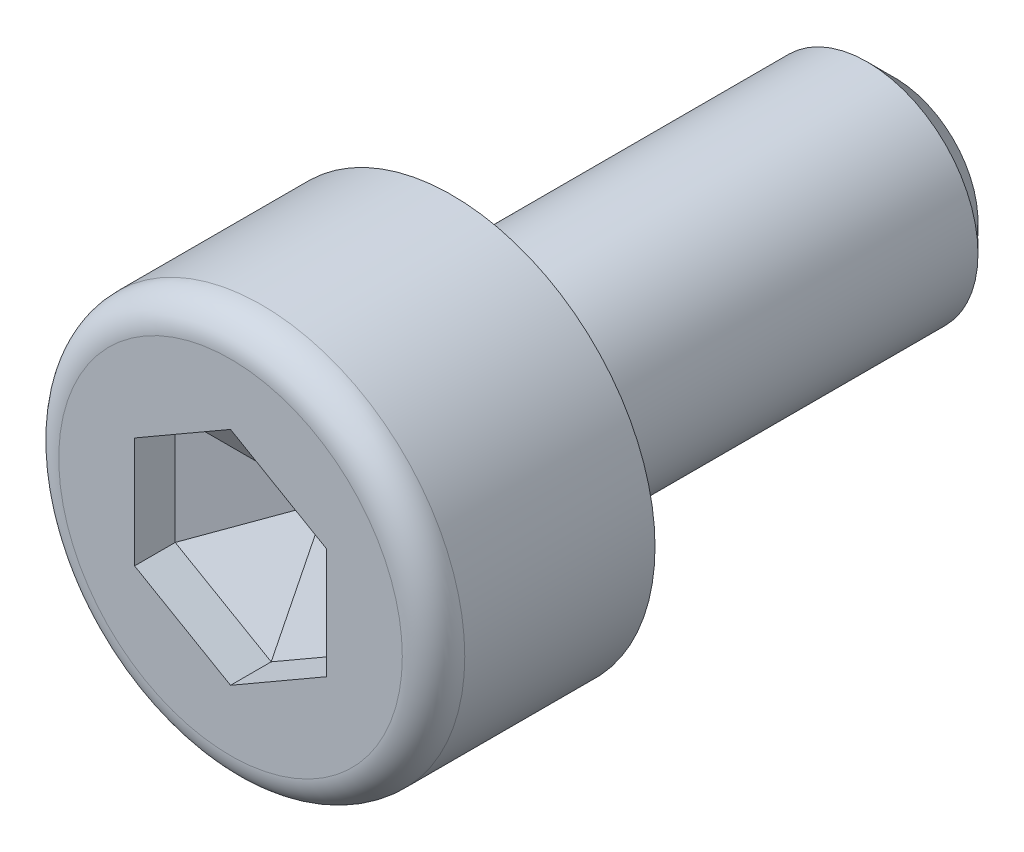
ISO-10303-21;
HEADER;
FILE_DESCRIPTION(('STEP AP214'),'2;1');
FILE_NAME('part.step','',(''),(''),'','','');
FILE_SCHEMA(('AUTOMOTIVE_DESIGN { 1 0 10303 214 1 1 1 1 }'));
ENDSEC;
DATA;
#1=APPLICATION_CONTEXT('core data for automotive mechanical design processes');
#2=APPLICATION_PROTOCOL_DEFINITION('international standard','automotive_design',2000,#1);
#3=PRODUCT_CONTEXT('',#1,'mechanical');
#4=PRODUCT('Part','Part','',(#3));
#5=PRODUCT_RELATED_PRODUCT_CATEGORY('part','',(#4));
#6=PRODUCT_DEFINITION_FORMATION('','',#4);
#7=PRODUCT_DEFINITION_CONTEXT('part definition',#1,'design');
#8=PRODUCT_DEFINITION('design','',#6,#7);
#9=PRODUCT_DEFINITION_SHAPE('','',#8);
#10=(LENGTH_UNIT() NAMED_UNIT(*) SI_UNIT(.MILLI.,.METRE.));
#11=(NAMED_UNIT(*) PLANE_ANGLE_UNIT() SI_UNIT($,.RADIAN.));
#12=(NAMED_UNIT(*) SI_UNIT($,.STERADIAN.) SOLID_ANGLE_UNIT());
#13=UNCERTAINTY_MEASURE_WITH_UNIT(LENGTH_MEASURE(1.E-05),#10,'distance_accuracy_value','');
#14=(GEOMETRIC_REPRESENTATION_CONTEXT(3) GLOBAL_UNCERTAINTY_ASSIGNED_CONTEXT((#13)) GLOBAL_UNIT_ASSIGNED_CONTEXT((#10,
#11,#12)) REPRESENTATION_CONTEXT('',''));
#15=CARTESIAN_POINT('',(0.,0.,0.));
#16=DIRECTION('',(0.,0.,1.));
#17=DIRECTION('',(1.,0.,0.));
#18=AXIS2_PLACEMENT_3D('',#15,#16,#17);
#19=CARTESIAN_POINT('',(0.,0.,0.));
#20=DIRECTION('',(0.,0.,1.));
#21=DIRECTION('',(1.,0.,0.));
#22=AXIS2_PLACEMENT_3D('',#19,#20,#21);
#23=PLANE('',#22);
#24=CARTESIAN_POINT('',(0.,0.,0.));
#25=DIRECTION('',(0.,0.,1.));
#26=DIRECTION('',(1.,0.,0.));
#27=AXIS2_PLACEMENT_3D('',#24,#25,#26);
#28=CIRCLE('',#27,1.6);
#29=CARTESIAN_POINT('',(1.6,0.,0.));
#30=VERTEX_POINT('',#29);
#31=EDGE_CURVE('E11',#30,#30,#28,.T.);
#32=ORIENTED_EDGE('',*,*,#31,.T.);
#33=EDGE_LOOP('',(#32));
#34=FACE_BOUND('',#33,.T.);
#35=CARTESIAN_POINT('',(0.,0.,0.));
#36=DIRECTION('',(0.,0.,1.));
#37=DIRECTION('',(1.,0.,0.));
#38=AXIS2_PLACEMENT_3D('',#35,#36,#37);
#39=CIRCLE('',#38,2.75);
#40=CARTESIAN_POINT('',(2.75,0.,0.));
#41=VERTEX_POINT('',#40);
#42=EDGE_CURVE('E160',#41,#41,#39,.T.);
#43=ORIENTED_EDGE('',*,*,#42,.F.);
#44=EDGE_LOOP('',(#43));
#45=FACE_BOUND('',#44,.T.);
#46=ADVANCED_FACE('F50',(#34,#45),#23,.F.);
#47=CARTESIAN_POINT('',(0.,0.,3.));
#48=DIRECTION('',(0.,0.,-1.));
#49=DIRECTION('',(-1.,0.,0.));
#50=AXIS2_PLACEMENT_3D('',#47,#48,#49);
#51=CYLINDRICAL_SURFACE('',#50,2.75);
#52=CARTESIAN_POINT('',(0.,0.,2.57692307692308));
#53=DIRECTION('',(0.,0.,1.));
#54=DIRECTION('',(1.,0.,0.));
#55=AXIS2_PLACEMENT_3D('',#52,#53,#54);
#56=CIRCLE('',#55,2.75);
#57=CARTESIAN_POINT('',(2.75,0.,2.57692307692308));
#58=VERTEX_POINT('',#57);
#59=EDGE_CURVE('E178',#58,#58,#56,.F.);
#60=ORIENTED_EDGE('',*,*,#59,.T.);
#61=EDGE_LOOP('',(#60));
#62=FACE_BOUND('',#61,.T.);
#63=ORIENTED_EDGE('',*,*,#42,.T.);
#64=EDGE_LOOP('',(#63));
#65=FACE_BOUND('',#64,.T.);
#66=ADVANCED_FACE('F237',(#62,#65),#51,.T.);
#67=CARTESIAN_POINT('',(0.,0.,3.));
#68=DIRECTION('',(0.,0.,1.));
#69=DIRECTION('',(1.,0.,0.));
#70=AXIS2_PLACEMENT_3D('',#67,#68,#69);
#71=PLANE('',#70);
#72=CARTESIAN_POINT('',(0.,0.,3.));
#73=DIRECTION('',(0.,0.,1.));
#74=DIRECTION('',(1.,0.,0.));
#75=AXIS2_PLACEMENT_3D('',#72,#73,#74);
#76=CIRCLE('',#75,2.32692307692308);
#77=CARTESIAN_POINT('',(2.32692307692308,0.,3.));
#78=VERTEX_POINT('',#77);
#79=EDGE_CURVE('E175',#78,#78,#76,.T.);
#80=ORIENTED_EDGE('',*,*,#79,.T.);
#81=EDGE_LOOP('',(#80));
#82=FACE_BOUND('',#81,.T.);
#83=DIRECTION('',(0.,1.,0.));
#84=VECTOR('',#83,1.);
#85=CARTESIAN_POINT('',(1.3,-0.750555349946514,3.));
#86=LINE('',#85,#84);
#87=CARTESIAN_POINT('',(1.3,-0.750555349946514,3.));
#88=VERTEX_POINT('',#87);
#89=CARTESIAN_POINT('',(1.3,0.750555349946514,3.));
#90=VERTEX_POINT('',#89);
#91=EDGE_CURVE('E142',#88,#90,#86,.T.);
#92=ORIENTED_EDGE('',*,*,#91,.F.);
#93=DIRECTION('',(0.866025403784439,0.5,0.));
#94=VECTOR('',#93,1.);
#95=CARTESIAN_POINT('',(0.,-1.50111069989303,3.));
#96=LINE('',#95,#94);
#97=CARTESIAN_POINT('',(0.,-1.50111069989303,3.));
#98=VERTEX_POINT('',#97);
#99=EDGE_CURVE('E155',#98,#88,#96,.T.);
#100=ORIENTED_EDGE('',*,*,#99,.F.);
#101=DIRECTION('',(0.866025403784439,-0.5,0.));
#102=VECTOR('',#101,1.);
#103=CARTESIAN_POINT('',(-1.3,-0.750555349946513,3.));
#104=LINE('',#103,#102);
#105=CARTESIAN_POINT('',(-1.3,-0.750555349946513,3.));
#106=VERTEX_POINT('',#105);
#107=EDGE_CURVE('E149',#106,#98,#104,.T.);
#108=ORIENTED_EDGE('',*,*,#107,.F.);
#109=DIRECTION('',(0.,-1.,0.));
#110=VECTOR('',#109,1.);
#111=CARTESIAN_POINT('',(-1.3,0.750555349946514,3.));
#112=LINE('',#111,#110);
#113=CARTESIAN_POINT('',(-1.3,0.750555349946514,3.));
#114=VERTEX_POINT('',#113);
#115=EDGE_CURVE('E147',#114,#106,#112,.T.);
#116=ORIENTED_EDGE('',*,*,#115,.F.);
#117=DIRECTION('',(-0.866025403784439,-0.5,0.));
#118=VECTOR('',#117,1.);
#119=CARTESIAN_POINT('',(0.,1.50111069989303,3.));
#120=LINE('',#119,#118);
#121=CARTESIAN_POINT('',(0.,1.50111069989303,3.));
#122=VERTEX_POINT('',#121);
#123=EDGE_CURVE('E127',#122,#114,#120,.T.);
#124=ORIENTED_EDGE('',*,*,#123,.F.);
#125=DIRECTION('',(-0.866025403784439,0.5,0.));
#126=VECTOR('',#125,1.);
#127=CARTESIAN_POINT('',(1.3,0.750555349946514,3.));
#128=LINE('',#127,#126);
#129=EDGE_CURVE('E137',#90,#122,#128,.T.);
#130=ORIENTED_EDGE('',*,*,#129,.F.);
#131=EDGE_LOOP('',(#92,#100,#108,#116,#124,#130));
#132=FACE_BOUND('',#131,.T.);
#133=ADVANCED_FACE('F144',(#82,#132),#71,.T.);
#134=CARTESIAN_POINT('',(1.3,-0.750555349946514,1.7));
#135=DIRECTION('',(1.,0.,0.));
#136=DIRECTION('',(0.,1.,0.));
#137=AXIS2_PLACEMENT_3D('',#134,#135,#136);
#138=PLANE('',#137);
#139=DIRECTION('',(0.,0.,1.));
#140=VECTOR('',#139,1.);
#141=CARTESIAN_POINT('',(1.3,0.750555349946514,1.7));
#142=LINE('',#141,#140);
#143=CARTESIAN_POINT('',(1.3,0.750555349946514,2.4492795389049));
#144=VERTEX_POINT('',#143);
#145=EDGE_CURVE('E134',#144,#90,#142,.T.);
#146=ORIENTED_EDGE('',*,*,#145,.F.);
#147=DIRECTION('',(0.,-1.,0.));
#148=VECTOR('',#147,1.);
#149=CARTESIAN_POINT('',(1.3,-0.750555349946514,2.4492795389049));
#150=LINE('',#149,#148);
#151=CARTESIAN_POINT('',(1.3,-0.750555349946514,2.4492795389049));
#152=VERTEX_POINT('',#151);
#153=EDGE_CURVE('E73',#144,#152,#150,.T.);
#154=ORIENTED_EDGE('',*,*,#153,.T.);
#155=DIRECTION('',(0.,0.,1.));
#156=VECTOR('',#155,1.);
#157=CARTESIAN_POINT('',(1.3,-0.750555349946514,1.7));
#158=LINE('',#157,#156);
#159=EDGE_CURVE('E158',#152,#88,#158,.T.);
#160=ORIENTED_EDGE('',*,*,#159,.T.);
#161=ORIENTED_EDGE('',*,*,#91,.T.);
#162=EDGE_LOOP('',(#146,#154,#160,#161));
#163=FACE_BOUND('',#162,.T.);
#164=ADVANCED_FACE('F297',(#163),#138,.F.);
#165=CARTESIAN_POINT('',(0.,-1.50111069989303,1.7));
#166=DIRECTION('',(0.5,-0.866025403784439,0.));
#167=DIRECTION('',(0.866025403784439,0.5,0.));
#168=AXIS2_PLACEMENT_3D('',#165,#166,#167);
#169=PLANE('',#168);
#170=ORIENTED_EDGE('',*,*,#159,.F.);
#171=DIRECTION('',(-0.866025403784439,-0.5,0.));
#172=VECTOR('',#171,1.);
#173=CARTESIAN_POINT('',(0.,-1.50111069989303,2.4492795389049));
#174=LINE('',#173,#172);
#175=CARTESIAN_POINT('',(0.,-1.50111069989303,2.4492795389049));
#176=VERTEX_POINT('',#175);
#177=EDGE_CURVE('E65',#152,#176,#174,.T.);
#178=ORIENTED_EDGE('',*,*,#177,.T.);
#179=DIRECTION('',(0.,0.,1.));
#180=VECTOR('',#179,1.);
#181=CARTESIAN_POINT('',(0.,-1.50111069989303,1.7));
#182=LINE('',#181,#180);
#183=EDGE_CURVE('E161',#176,#98,#182,.T.);
#184=ORIENTED_EDGE('',*,*,#183,.T.);
#185=ORIENTED_EDGE('',*,*,#99,.T.);
#186=EDGE_LOOP('',(#170,#178,#184,#185));
#187=FACE_BOUND('',#186,.T.);
#188=ADVANCED_FACE('F299',(#187),#169,.F.);
#189=CARTESIAN_POINT('',(-1.3,-0.750555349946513,1.7));
#190=DIRECTION('',(-0.5,-0.866025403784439,0.));
#191=DIRECTION('',(0.866025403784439,-0.5,0.));
#192=AXIS2_PLACEMENT_3D('',#189,#190,#191);
#193=PLANE('',#192);
#194=ORIENTED_EDGE('',*,*,#183,.F.);
#195=DIRECTION('',(-0.866025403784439,0.5,0.));
#196=VECTOR('',#195,1.);
#197=CARTESIAN_POINT('',(-1.3,-0.750555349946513,2.4492795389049));
#198=LINE('',#197,#196);
#199=CARTESIAN_POINT('',(-1.3,-0.750555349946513,2.4492795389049));
#200=VERTEX_POINT('',#199);
#201=EDGE_CURVE('E201',#176,#200,#198,.T.);
#202=ORIENTED_EDGE('',*,*,#201,.T.);
#203=DIRECTION('',(0.,0.,1.));
#204=VECTOR('',#203,1.);
#205=CARTESIAN_POINT('',(-1.3,-0.750555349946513,1.7));
#206=LINE('',#205,#204);
#207=EDGE_CURVE('E163',#200,#106,#206,.T.);
#208=ORIENTED_EDGE('',*,*,#207,.T.);
#209=ORIENTED_EDGE('',*,*,#107,.T.);
#210=EDGE_LOOP('',(#194,#202,#208,#209));
#211=FACE_BOUND('',#210,.T.);
#212=ADVANCED_FACE('F288',(#211),#193,.F.);
#213=CARTESIAN_POINT('',(-1.3,0.750555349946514,1.7));
#214=DIRECTION('',(-1.,0.,0.));
#215=DIRECTION('',(0.,0.,1.));
#216=AXIS2_PLACEMENT_3D('',#213,#214,#215);
#217=PLANE('',#216);
#218=ORIENTED_EDGE('',*,*,#207,.F.);
#219=DIRECTION('',(0.,1.,0.));
#220=VECTOR('',#219,1.);
#221=CARTESIAN_POINT('',(-1.3,0.750555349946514,2.4492795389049));
#222=LINE('',#221,#220);
#223=CARTESIAN_POINT('',(-1.3,0.750555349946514,2.4492795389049));
#224=VERTEX_POINT('',#223);
#225=EDGE_CURVE('E194',#200,#224,#222,.T.);
#226=ORIENTED_EDGE('',*,*,#225,.T.);
#227=DIRECTION('',(0.,0.,1.));
#228=VECTOR('',#227,1.);
#229=CARTESIAN_POINT('',(-1.3,0.750555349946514,1.7));
#230=LINE('',#229,#228);
#231=EDGE_CURVE('E133',#224,#114,#230,.T.);
#232=ORIENTED_EDGE('',*,*,#231,.T.);
#233=ORIENTED_EDGE('',*,*,#115,.T.);
#234=EDGE_LOOP('',(#218,#226,#232,#233));
#235=FACE_BOUND('',#234,.T.);
#236=ADVANCED_FACE('F291',(#235),#217,.F.);
#237=CARTESIAN_POINT('',(0.,1.50111069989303,1.7));
#238=DIRECTION('',(-0.5,0.866025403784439,0.));
#239=DIRECTION('',(-0.866025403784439,-0.5,0.));
#240=AXIS2_PLACEMENT_3D('',#237,#238,#239);
#241=PLANE('',#240);
#242=ORIENTED_EDGE('',*,*,#231,.F.);
#243=DIRECTION('',(0.866025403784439,0.5,0.));
#244=VECTOR('',#243,1.);
#245=CARTESIAN_POINT('',(0.,1.50111069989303,2.4492795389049));
#246=LINE('',#245,#244);
#247=CARTESIAN_POINT('',(0.,1.50111069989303,2.4492795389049));
#248=VERTEX_POINT('',#247);
#249=EDGE_CURVE('E130',#224,#248,#246,.T.);
#250=ORIENTED_EDGE('',*,*,#249,.T.);
#251=DIRECTION('',(0.,0.,1.));
#252=VECTOR('',#251,1.);
#253=CARTESIAN_POINT('',(0.,1.50111069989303,1.7));
#254=LINE('',#253,#252);
#255=EDGE_CURVE('E122',#248,#122,#254,.T.);
#256=ORIENTED_EDGE('',*,*,#255,.T.);
#257=ORIENTED_EDGE('',*,*,#123,.T.);
#258=EDGE_LOOP('',(#242,#250,#256,#257));
#259=FACE_BOUND('',#258,.T.);
#260=ADVANCED_FACE('F125',(#259),#241,.F.);
#261=CARTESIAN_POINT('',(1.3,0.750555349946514,1.7));
#262=DIRECTION('',(0.5,0.866025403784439,0.));
#263=DIRECTION('',(-0.866025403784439,0.5,0.));
#264=AXIS2_PLACEMENT_3D('',#261,#262,#263);
#265=PLANE('',#264);
#266=ORIENTED_EDGE('',*,*,#255,.F.);
#267=DIRECTION('',(0.866025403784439,-0.5,0.));
#268=VECTOR('',#267,1.);
#269=CARTESIAN_POINT('',(1.3,0.750555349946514,2.4492795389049));
#270=LINE('',#269,#268);
#271=EDGE_CURVE('E198',#248,#144,#270,.T.);
#272=ORIENTED_EDGE('',*,*,#271,.T.);
#273=ORIENTED_EDGE('',*,*,#145,.T.);
#274=ORIENTED_EDGE('',*,*,#129,.T.);
#275=EDGE_LOOP('',(#266,#272,#273,#274));
#276=FACE_BOUND('',#275,.T.);
#277=ADVANCED_FACE('F138',(#276),#265,.F.);
#278=CARTESIAN_POINT('',(0.,0.,1.7));
#279=DIRECTION('',(0.,0.,1.));
#280=DIRECTION('',(1.,0.,0.));
#281=AXIS2_PLACEMENT_3D('',#278,#279,#280);
#282=PLANE('',#281);
#283=DIRECTION('',(-0.866025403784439,-0.5,0.));
#284=VECTOR('',#283,1.);
#285=CARTESIAN_POINT('',(-0.00110488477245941,0.00191371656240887,1.7));
#286=LINE('',#285,#284);
#287=CARTESIAN_POINT('',(0.,0.00255162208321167,1.7));
#288=VERTEX_POINT('',#287);
#289=CARTESIAN_POINT('',(-0.00220976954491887,0.0012758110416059,1.7));
#290=VERTEX_POINT('',#289);
#291=EDGE_CURVE('E189',#288,#290,#286,.T.);
#292=ORIENTED_EDGE('',*,*,#291,.T.);
#293=DIRECTION('',(0.,-1.,0.));
#294=VECTOR('',#293,1.);
#295=CARTESIAN_POINT('',(-0.00220976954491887,0.,1.7));
#296=LINE('',#295,#294);
#297=CARTESIAN_POINT('',(-0.00220976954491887,-0.00127581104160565,1.7));
#298=VERTEX_POINT('',#297);
#299=EDGE_CURVE('E191',#290,#298,#296,.T.);
#300=ORIENTED_EDGE('',*,*,#299,.T.);
#301=DIRECTION('',(0.866025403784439,-0.5,0.));
#302=VECTOR('',#301,1.);
#303=CARTESIAN_POINT('',(-0.0011048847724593,-0.00191371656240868,1.7));
#304=LINE('',#303,#302);
#305=CARTESIAN_POINT('',(0.,-0.00255162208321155,1.7));
#306=VERTEX_POINT('',#305);
#307=EDGE_CURVE('E183',#298,#306,#304,.T.);
#308=ORIENTED_EDGE('',*,*,#307,.T.);
#309=DIRECTION('',(0.866025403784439,0.5,0.));
#310=VECTOR('',#309,1.);
#311=CARTESIAN_POINT('',(0.00110488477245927,-0.00191371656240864,1.7));
#312=LINE('',#311,#310);
#313=CARTESIAN_POINT('',(0.00220976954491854,-0.0012758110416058,1.7));
#314=VERTEX_POINT('',#313);
#315=EDGE_CURVE('E181',#306,#314,#312,.T.);
#316=ORIENTED_EDGE('',*,*,#315,.T.);
#317=DIRECTION('',(0.,1.,0.));
#318=VECTOR('',#317,1.);
#319=CARTESIAN_POINT('',(0.00220976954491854,0.,1.7));
#320=LINE('',#319,#318);
#321=CARTESIAN_POINT('',(0.00220976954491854,0.00127581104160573,1.7));
#322=VERTEX_POINT('',#321);
#323=EDGE_CURVE('E185',#314,#322,#320,.T.);
#324=ORIENTED_EDGE('',*,*,#323,.T.);
#325=DIRECTION('',(-0.866025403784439,0.5,0.));
#326=VECTOR('',#325,1.);
#327=CARTESIAN_POINT('',(0.00110488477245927,0.00191371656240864,1.7));
#328=LINE('',#327,#326);
#329=EDGE_CURVE('E187',#322,#288,#328,.T.);
#330=ORIENTED_EDGE('',*,*,#329,.T.);
#331=EDGE_LOOP('',(#292,#300,#308,#316,#324,#330));
#332=FACE_BOUND('',#331,.T.);
#333=ADVANCED_FACE('F308',(#332),#282,.T.);
#334=CARTESIAN_POINT('',(0.,0.,-6.));
#335=DIRECTION('',(0.,0.,1.));
#336=DIRECTION('',(1.,0.,0.));
#337=AXIS2_PLACEMENT_3D('',#334,#335,#336);
#338=CYLINDRICAL_SURFACE('',#337,1.5);
#339=CARTESIAN_POINT('',(0.,0.,-0.1));
#340=DIRECTION('',(0.,0.,1.));
#341=DIRECTION('',(1.,0.,0.));
#342=AXIS2_PLACEMENT_3D('',#339,#340,#341);
#343=CIRCLE('',#342,1.5);
#344=CARTESIAN_POINT('',(1.5,0.,-0.1));
#345=VERTEX_POINT('',#344);
#346=EDGE_CURVE('E58',#345,#345,#343,.F.);
#347=ORIENTED_EDGE('',*,*,#346,.T.);
#348=EDGE_LOOP('',(#347));
#349=FACE_BOUND('',#348,.T.);
#350=CARTESIAN_POINT('',(0.,0.,-5.625));
#351=DIRECTION('',(0.,0.,-1.));
#352=DIRECTION('',(-1.,0.,0.));
#353=AXIS2_PLACEMENT_3D('',#350,#351,#352);
#354=CIRCLE('',#353,1.5);
#355=CARTESIAN_POINT('',(-1.5,0.,-5.625));
#356=VERTEX_POINT('',#355);
#357=EDGE_CURVE('E172',#356,#356,#354,.F.);
#358=ORIENTED_EDGE('',*,*,#357,.T.);
#359=EDGE_LOOP('',(#358));
#360=FACE_BOUND('',#359,.T.);
#361=ADVANCED_FACE('F222',(#349,#360),#338,.T.);
#362=CARTESIAN_POINT('',(0.,0.,-6.));
#363=DIRECTION('',(0.,0.,-1.));
#364=DIRECTION('',(-1.,0.,0.));
#365=AXIS2_PLACEMENT_3D('',#362,#363,#364);
#366=PLANE('',#365);
#367=CARTESIAN_POINT('',(0.,0.,-6.));
#368=DIRECTION('',(0.,0.,-1.));
#369=DIRECTION('',(-1.,0.,0.));
#370=AXIS2_PLACEMENT_3D('',#367,#368,#369);
#371=CIRCLE('',#370,1.125);
#372=CARTESIAN_POINT('',(-1.125,0.,-6.));
#373=VERTEX_POINT('',#372);
#374=EDGE_CURVE('E169',#373,#373,#371,.T.);
#375=ORIENTED_EDGE('',*,*,#374,.T.);
#376=EDGE_LOOP('',(#375));
#377=FACE_BOUND('',#376,.T.);
#378=ADVANCED_FACE('F253',(#377),#366,.T.);
#379=CARTESIAN_POINT('',(0.,0.,-6.));
#380=DIRECTION('',(0.,0.,1.));
#381=DIRECTION('',(1.,0.,0.));
#382=AXIS2_PLACEMENT_3D('',#379,#380,#381);
#383=CONICAL_SURFACE('',#382,1.125,0.785398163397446);
#384=ORIENTED_EDGE('',*,*,#357,.F.);
#385=EDGE_LOOP('',(#384));
#386=FACE_BOUND('',#385,.T.);
#387=ORIENTED_EDGE('',*,*,#374,.F.);
#388=EDGE_LOOP('',(#387));
#389=FACE_BOUND('',#388,.T.);
#390=ADVANCED_FACE('F249',(#386,#389),#383,.T.);
#391=CARTESIAN_POINT('',(0.,0.,2.57692307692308));
#392=DIRECTION('',(0.,0.,1.));
#393=DIRECTION('',(1.,0.,0.));
#394=AXIS2_PLACEMENT_3D('',#391,#392,#393);
#395=TOROIDAL_SURFACE('',#394,2.32692307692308,0.423076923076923);
#396=ORIENTED_EDGE('',*,*,#59,.F.);
#397=EDGE_LOOP('',(#396));
#398=FACE_BOUND('',#397,.T.);
#399=ORIENTED_EDGE('',*,*,#79,.F.);
#400=EDGE_LOOP('',(#399));
#401=FACE_BOUND('',#400,.T.);
#402=ADVANCED_FACE('F252',(#398,#401),#395,.T.);
#403=CARTESIAN_POINT('',(0.00220976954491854,0.,1.7));
#404=DIRECTION('',(0.499999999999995,0.,-0.866025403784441));
#405=DIRECTION('',(0.,1.,0.));
#406=AXIS2_PLACEMENT_3D('',#403,#404,#405);
#407=PLANE('',#406);
#408=DIRECTION('',(-0.774596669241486,0.447213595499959,-0.447213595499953));
#409=VECTOR('',#408,1.);
#410=CARTESIAN_POINT('',(0.00176781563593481,-0.00102064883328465,1.69974483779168));
#411=LINE('',#410,#409);
#412=EDGE_CURVE('E214',#152,#314,#411,.T.);
#413=ORIENTED_EDGE('',*,*,#412,.F.);
#414=ORIENTED_EDGE('',*,*,#153,.F.);
#415=DIRECTION('',(-0.774596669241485,-0.447213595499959,-0.447213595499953));
#416=VECTOR('',#415,1.);
#417=CARTESIAN_POINT('',(0.00176781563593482,0.00102064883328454,1.69974483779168));
#418=LINE('',#417,#416);
#419=EDGE_CURVE('E217',#322,#144,#418,.F.);
#420=ORIENTED_EDGE('',*,*,#419,.F.);
#421=ORIENTED_EDGE('',*,*,#323,.F.);
#422=EDGE_LOOP('',(#413,#414,#420,#421));
#423=FACE_BOUND('',#422,.T.);
#424=ADVANCED_FACE('F256',(#423),#407,.F.);
#425=CARTESIAN_POINT('',(0.00110488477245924,0.00191371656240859,1.7));
#426=DIRECTION('',(0.249999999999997,0.433012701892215,-0.866025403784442));
#427=DIRECTION('',(-0.866025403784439,0.5,0.));
#428=AXIS2_PLACEMENT_3D('',#425,#426,#427);
#429=PLANE('',#428);
#430=ORIENTED_EDGE('',*,*,#419,.T.);
#431=ORIENTED_EDGE('',*,*,#271,.F.);
#432=DIRECTION('',(0.,-0.894427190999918,-0.447213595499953));
#433=VECTOR('',#432,1.);
#434=CARTESIAN_POINT('',(0.,0.00204129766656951,1.69974483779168));
#435=LINE('',#434,#433);
#436=EDGE_CURVE('E211',#288,#248,#435,.F.);
#437=ORIENTED_EDGE('',*,*,#436,.F.);
#438=ORIENTED_EDGE('',*,*,#329,.F.);
#439=EDGE_LOOP('',(#430,#431,#437,#438));
#440=FACE_BOUND('',#439,.T.);
#441=ADVANCED_FACE('F269',(#440),#429,.F.);
#442=CARTESIAN_POINT('',(0.0011048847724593,-0.00191371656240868,1.7));
#443=DIRECTION('',(0.249999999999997,-0.433012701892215,-0.866025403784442));
#444=DIRECTION('',(0.866025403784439,0.5,0.));
#445=AXIS2_PLACEMENT_3D('',#442,#443,#444);
#446=PLANE('',#445);
#447=ORIENTED_EDGE('',*,*,#412,.T.);
#448=ORIENTED_EDGE('',*,*,#315,.F.);
#449=DIRECTION('',(0.,-0.894427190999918,0.447213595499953));
#450=VECTOR('',#449,1.);
#451=CARTESIAN_POINT('',(0.,-0.00204129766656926,1.69974483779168));
#452=LINE('',#451,#450);
#453=EDGE_CURVE('E208',#176,#306,#452,.F.);
#454=ORIENTED_EDGE('',*,*,#453,.F.);
#455=ORIENTED_EDGE('',*,*,#177,.F.);
#456=EDGE_LOOP('',(#447,#448,#454,#455));
#457=FACE_BOUND('',#456,.T.);
#458=ADVANCED_FACE('F265',(#457),#446,.F.);
#459=CARTESIAN_POINT('',(-0.00110488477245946,0.00191371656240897,1.7));
#460=DIRECTION('',(-0.249999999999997,0.433012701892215,-0.866025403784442));
#461=DIRECTION('',(-0.866025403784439,-0.5,0.));
#462=AXIS2_PLACEMENT_3D('',#459,#460,#461);
#463=PLANE('',#462);
#464=ORIENTED_EDGE('',*,*,#436,.T.);
#465=ORIENTED_EDGE('',*,*,#249,.F.);
#466=DIRECTION('',(0.774596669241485,-0.447213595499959,-0.447213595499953));
#467=VECTOR('',#466,1.);
#468=CARTESIAN_POINT('',(-0.00176781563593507,0.00102064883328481,1.69974483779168));
#469=LINE('',#468,#467);
#470=EDGE_CURVE('E206',#290,#224,#469,.F.);
#471=ORIENTED_EDGE('',*,*,#470,.F.);
#472=ORIENTED_EDGE('',*,*,#291,.F.);
#473=EDGE_LOOP('',(#464,#465,#471,#472));
#474=FACE_BOUND('',#473,.T.);
#475=ADVANCED_FACE('F261',(#474),#463,.F.);
#476=CARTESIAN_POINT('',(-0.0011048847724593,-0.00191371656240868,1.7));
#477=DIRECTION('',(-0.249999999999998,-0.433012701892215,-0.866025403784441));
#478=DIRECTION('',(0.866025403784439,-0.5,0.));
#479=AXIS2_PLACEMENT_3D('',#476,#477,#478);
#480=PLANE('',#479);
#481=ORIENTED_EDGE('',*,*,#453,.T.);
#482=ORIENTED_EDGE('',*,*,#307,.F.);
#483=DIRECTION('',(-0.774596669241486,-0.447213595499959,0.447213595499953));
#484=VECTOR('',#483,1.);
#485=CARTESIAN_POINT('',(-0.0017678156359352,-0.00102064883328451,1.69974483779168));
#486=LINE('',#485,#484);
#487=EDGE_CURVE('E204',#200,#298,#486,.F.);
#488=ORIENTED_EDGE('',*,*,#487,.F.);
#489=ORIENTED_EDGE('',*,*,#201,.F.);
#490=EDGE_LOOP('',(#481,#482,#488,#489));
#491=FACE_BOUND('',#490,.T.);
#492=ADVANCED_FACE('F232',(#491),#480,.F.);
#493=CARTESIAN_POINT('',(-0.00220976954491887,0.,1.7));
#494=DIRECTION('',(-0.499999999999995,0.,-0.866025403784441));
#495=DIRECTION('',(0.,-1.,0.));
#496=AXIS2_PLACEMENT_3D('',#493,#494,#495);
#497=PLANE('',#496);
#498=ORIENTED_EDGE('',*,*,#470,.T.);
#499=ORIENTED_EDGE('',*,*,#225,.F.);
#500=ORIENTED_EDGE('',*,*,#487,.T.);
#501=ORIENTED_EDGE('',*,*,#299,.F.);
#502=EDGE_LOOP('',(#498,#499,#500,#501));
#503=FACE_BOUND('',#502,.T.);
#504=ADVANCED_FACE('F226',(#503),#497,.F.);
#505=CARTESIAN_POINT('',(0.,0.,-0.1));
#506=DIRECTION('',(0.,0.,1.));
#507=DIRECTION('',(1.,0.,0.));
#508=AXIS2_PLACEMENT_3D('',#505,#506,#507);
#509=TOROIDAL_SURFACE('',#508,1.6,0.1);
#510=ORIENTED_EDGE('',*,*,#31,.F.);
#511=EDGE_LOOP('',(#510));
#512=FACE_BOUND('',#511,.T.);
#513=ORIENTED_EDGE('',*,*,#346,.F.);
#514=EDGE_LOOP('',(#513));
#515=FACE_BOUND('',#514,.T.);
#516=ADVANCED_FACE('F52',(#512,#515),#509,.F.);
#517=CLOSED_SHELL('',(#46,#66,#133,#164,#188,#212,#236,#260,#277,#333,#361,#378,#390,#402,#424,
#441,#458,#475,#492,#504,#516));
#518=MANIFOLD_SOLID_BREP('B2',#517);
#519=ADVANCED_BREP_SHAPE_REPRESENTATION('',(#18,#518),#14);
#520=SHAPE_DEFINITION_REPRESENTATION(#9,#519);
ENDSEC;
END-ISO-10303-21;
